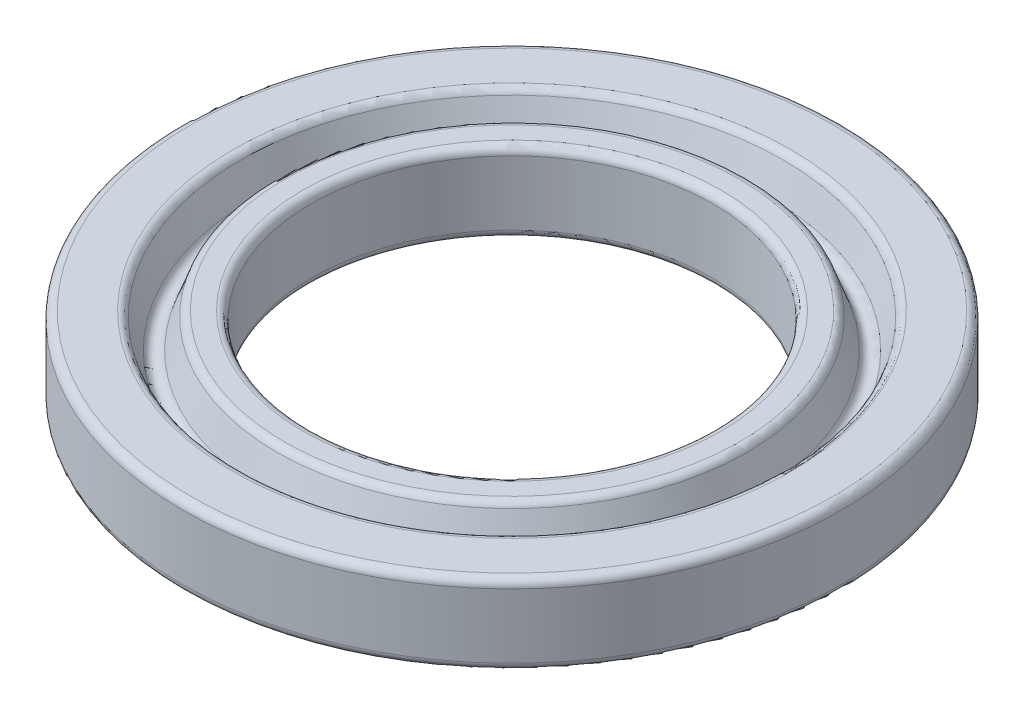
from build123d import *

# Parameters (mm, degrees)
CONG_1_R = 0.25


with BuildPart() as part:
    # Esquisse1 → Base-R_volution (revolve)
    with BuildSketch(Plane.XY, mode=Mode.PRIVATE) as base_r_volution_sk:
        Polygon((7.25, 2.5), (7.875, 0.782826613), (8.5, 2.5), (10.25, 2.5), (10.25, 0), (9.25, 0), (8.757053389, 1.354359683), (8.25, 0), (6.25, 0), (6.25, 2.5), align=None)
    revolve(base_r_volution_sk.sketch.rotate(Axis((0, 40, 0), (0, -1, 0)), 90), axis=Axis((0, 40, 0), (0, -1, 0)))

    # Cong_1
    cong_1_edges = [part.edges().sort_by_distance(p)[0] for p in [
        (0, 2.5, -7.25),
        (0, 0.782826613, -7.875),
        (0, 2.5, -8.5),
        (0, 2.5, -10.25),
        (0, 0, -10.25),
        (0, 0, -9.25),
        (0, 1.354359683, -8.757053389),
        (0, 0, -8.25),
        (0, 0, -6.25),
        (0, 2.5, -6.25),
    ]]
    fillet(cong_1_edges, radius=CONG_1_R)


solid = part.part
